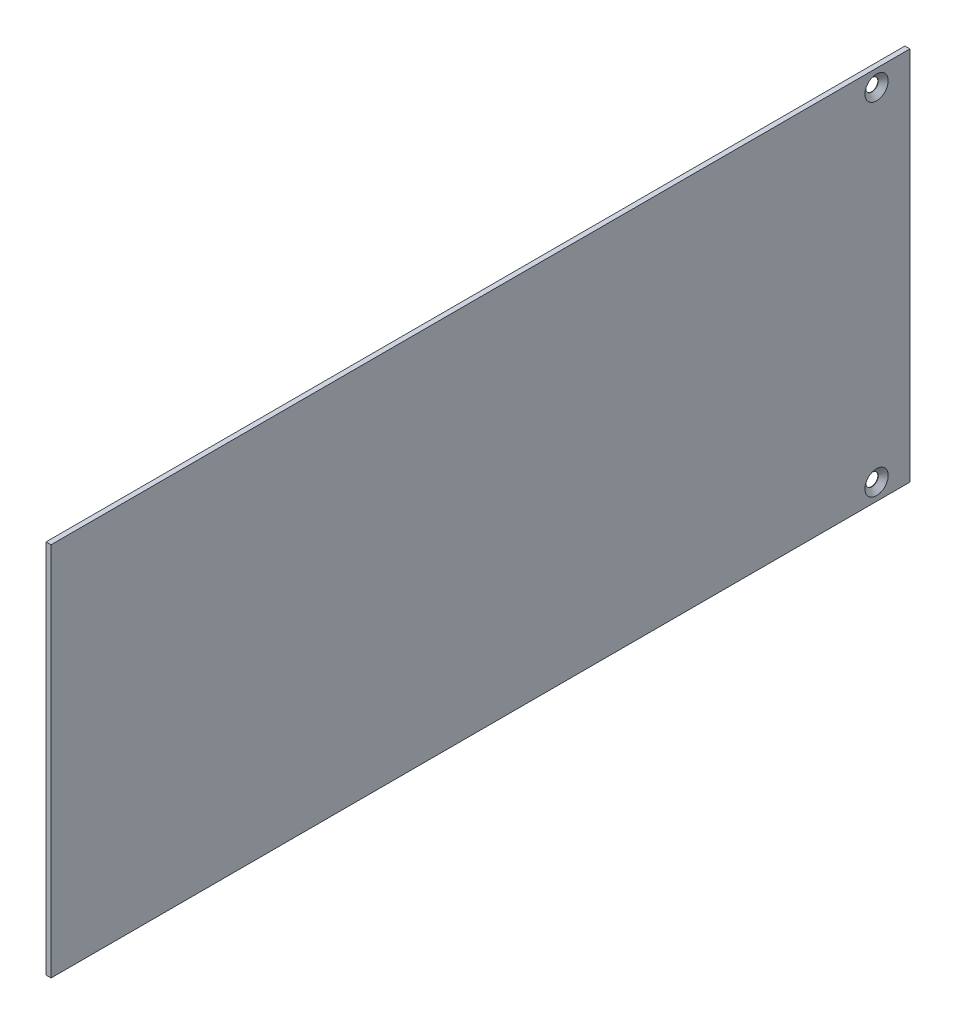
from build123d import *

# Parameters (mm, degrees)
SKETCH1_W                                 = 1.524
SKETCH1_H                                 = 114.3
BOSS_EXTRUDE1_DEPTH                       = 130.81
CSK_FOR_6_FLAT_HEAD_MACHINE_SCREW_2_COUNT = 2
CSK_FOR_6_FLAT_HEAD_MACHINE_SCREW_2_PITCH = 104.14


with BuildPart() as part:
    # Sketch1 → Boss-Extrude1 (new, symmetric)
    with BuildSketch(Plane.XY):
        with Locations((-0.762, 0)):
            Rectangle(SKETCH1_W, SKETCH1_H)
    extrude(amount=BOSS_EXTRUDE1_DEPTH, both=True)

    # Sketch3 → CSK for _6 Flat Head Machine Screw _100 (revolve, cut)
    with BuildSketch(Plane(origin=(0, 52.07, -120.65), x_dir=(0, 0, -1), z_dir=(0, 1, 0))):
        Polygon((0, 0), (0, 1.524), (1.89865, 1.524), (1.89865, 1.380029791), (3.543305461, 0), align=None)
    csk_for_6_flat_head_machine_screw_100 = revolve(axis=Axis((6.35, 52.07, -120.65), (-1, 0, 0)), mode=Mode.SUBTRACT)

    # CSK for _6 Flat Head Machine Screw _ 2: CSK for _6 Flat Head Machine Screw _100 ×2
    with Locations(*[(0, -i * CSK_FOR_6_FLAT_HEAD_MACHINE_SCREW_2_PITCH, 0) for i in range(1, CSK_FOR_6_FLAT_HEAD_MACHINE_SCREW_2_COUNT)]):
        add(csk_for_6_flat_head_machine_screw_100, mode=Mode.SUBTRACT)


solid = part.part
